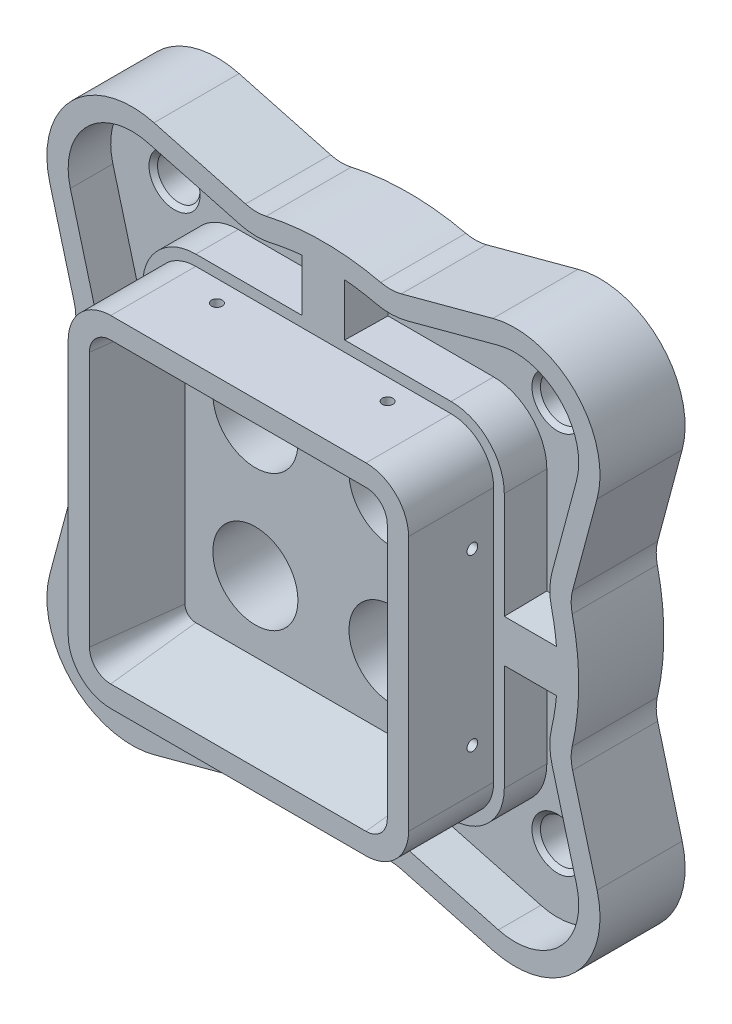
from build123d import *

# Parameters (mm, degrees)
BASE_EXTRUDE_DEPTH      = 25.4
BOSS_EXTRUDE1_DEPTH     = 25.4
CUT_EXTRUDE1_DEPTH      = 25.4
CUT_EXTRUDE1_DRAFT      = -7
SKETCH4_R               = 12.7
CUT_EXTRUDE2_DEPTH      = 120.474537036
CUT_EXTRUDE3_DEPTH      = 12.7
BOSS_EXTRUDE2_START     = -12.7
SKETCH6_W               = 25.134955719
SKETCH6_H               = 12.7
BOSS_EXTRUDE2_DEPTH     = 12.7
CIRPATTERN1_COUNT       = 4
CUT_EXTRUDE4_DEPTH      = 12.7
CUT_EXTRUDE4_DEPTH_BACK = 123.803155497
SKETCH7_R               = 6.35
DRAFT1_ANGLE            = 1
CHAMFER1_SIZE           = 1.27
HOLE1_D                 = 3.175
HOLE1_DEPTH             = 5.08
HOLE1_TIP               = 0.953866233
HOLE2_D                 = 3.175
HOLE2_DEPTH             = 5.08
HOLE2_TIP               = 0.953866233
HOLE3_D                 = 3.175
HOLE3_DEPTH             = 5.08
HOLE3_TIP               = 0.953866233
HOLE4_D                 = 3.175
HOLE4_DEPTH             = 5.08
HOLE4_TIP               = 0.953866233
HOLE5_D                 = 3.175
HOLE5_DEPTH             = 5.08
HOLE5_TIP               = 0.953866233
HOLE6_D                 = 3.175
HOLE6_DEPTH             = 5.08
HOLE6_TIP               = 0.953866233
HOLE7_D                 = 3.175
HOLE7_DEPTH             = 5.08
HOLE7_TIP               = 0.953866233
HOLE8_D                 = 3.175
HOLE8_DEPTH             = 5.08
HOLE8_TIP               = 0.953866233
CUT_EXTRUDE5_START      = -3.175
SKETCH17_R              = 69.85
SKETCH17_R_2            = 50.8
CUT_EXTRUDE5_DEPTH      = 3.175


with BuildPart() as part:
    # Sketch1 → Base-Extrude (new body)
    with BuildSketch(Plane.XY):
        with BuildLine():
            Line((-50.575996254, 81.684515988), (-23.24962088, 74.362435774))
            ThreePointArc((-23.24962088, 74.362435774), (-20.186868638, 73.931673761), (-17.110816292, 74.25402323))
            ThreePointArc((-17.110816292, 74.25402323), (0, 76.2), (17.110816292, 74.25402323))
            ThreePointArc((17.110816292, 74.25402323), (20.186868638, 73.931673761), (23.24962088, 74.362435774))
            Line((23.24962088, 74.362435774), (50.575996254, 81.684515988))
            ThreePointArc((50.575996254, 81.684515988), (75.110512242, 75.110512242), (81.684515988, 50.575996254))
            Line((81.684515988, 50.575996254), (74.362435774, 23.24962088))
            ThreePointArc((74.362435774, 23.24962088), (73.931673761, 20.186868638), (74.25402323, 17.110816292))
            ThreePointArc((74.25402323, 17.110816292), (76.2, 0), (74.25402323, -17.110816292))
            ThreePointArc((74.25402323, -17.110816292), (73.931673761, -20.186868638), (74.362435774, -23.24962088))
            Line((74.362435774, -23.24962088), (81.684515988, -50.575996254))
            ThreePointArc((81.684515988, -50.575996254), (75.110512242, -75.110512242), (50.575996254, -81.684515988))
            Line((50.575996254, -81.684515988), (23.24962088, -74.362435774))
            ThreePointArc((23.24962088, -74.362435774), (20.186868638, -73.931673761), (17.110816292, -74.25402323))
            ThreePointArc((17.110816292, -74.25402323), (0, -76.2), (-17.110816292, -74.25402323))
            ThreePointArc((-17.110816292, -74.25402323), (-20.186868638, -73.931673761), (-23.24962088, -74.362435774))
            Line((-23.24962088, -74.362435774), (-50.575996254, -81.684515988))
            ThreePointArc((-50.575996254, -81.684515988), (-75.110512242, -75.110512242), (-81.684515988, -50.575996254))
            Line((-81.684515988, -50.575996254), (-74.362435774, -23.24962088))
            ThreePointArc((-74.362435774, -23.24962088), (-73.931673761, -20.186868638), (-74.25402323, -17.110816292))
            ThreePointArc((-74.25402323, -17.110816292), (-76.2, 0), (-74.25402323, 17.110816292))
            ThreePointArc((-74.25402323, 17.110816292), (-73.931673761, 20.186868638), (-74.362435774, 23.24962088))
            Line((-74.362435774, 23.24962088), (-81.684515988, 50.575996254))
            ThreePointArc((-81.684515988, 50.575996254), (-75.110512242, 75.110512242), (-50.575996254, 81.684515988))
        make_face()
    extrude(amount=BASE_EXTRUDE_DEPTH)

    # Sketch2 → Boss-Extrude1 (add)
    with BuildSketch(Plane.XY.offset(25.4)):
        with BuildLine():
            Line((-38.1, 50.8), (38.1, 50.8))
            ThreePointArc((38.1, 50.8), (47.080256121, 47.080256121), (50.8, 38.1))
            Line((50.8, 38.1), (50.8, -38.1))
            ThreePointArc((50.8, -38.1), (47.080256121, -47.080256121), (38.1, -50.8))
            Line((38.1, -50.8), (-38.1, -50.8))
            ThreePointArc((-38.1, -50.8), (-47.080256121, -47.080256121), (-50.8, -38.1))
            Line((-50.8, -38.1), (-50.8, 38.1))
            ThreePointArc((-50.8, 38.1), (-47.080256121, 47.080256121), (-38.1, 50.8))
        make_face()
    extrude(amount=BOSS_EXTRUDE1_DEPTH)


with BuildPart() as cut_extrude1_tool:
    # Sketch3 → Cut-Extrude1 (with draft: the straight prism first)
    with BuildSketch(Plane.XY.offset(50.8)):
        with BuildLine():
            Line((-44.45, 38.1), (-44.45, -38.1))
            ThreePointArc((-44.45, -38.1), (-42.590128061, -42.590128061), (-38.1, -44.45))
            Line((-38.1, -44.45), (38.1, -44.45))
            ThreePointArc((38.1, -44.45), (42.590128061, -42.590128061), (44.45, -38.1))
            Line((44.45, -38.1), (44.45, 38.1))
            ThreePointArc((44.45, 38.1), (42.590128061, 42.590128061), (38.1, 44.45))
            Line((38.1, 44.45), (-38.1, 44.45))
            ThreePointArc((-38.1, 44.45), (-42.590128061, 42.590128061), (-44.45, 38.1))
        make_face()
    extrude(amount=-CUT_EXTRUDE1_DEPTH)
    # Cut-Extrude1: the draft: its side faces are tilted about the plane it starts from
    cut_extrude1_sides = [cut_extrude1_tool.faces().sort_by_distance(p)[0] for p in [
        (-42.590128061, 42.590128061, 38.1),
        (-44.45, 0, 38.1),
        (-42.590128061, -42.590128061, 38.1),
        (0, -44.45, 38.1),
        (42.590128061, -42.590128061, 38.1),
        (44.45, 0, 38.1),
        (42.590128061, 42.590128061, 38.1),
        (0, 44.45, 38.1),
    ]]
    draft(cut_extrude1_sides, Plane.XY.offset(50.8), CUT_EXTRUDE1_DRAFT)


with BuildPart() as part_1:
    add(part.part)

    # Cut-Extrude1: cut by cut_extrude1_tool
    add(cut_extrude1_tool.part, mode=Mode.SUBTRACT)

    # Sketch4 → Cut-Extrude2 (cut, through all)
    with BuildSketch(Plane.XY.offset(25.4)):
        with Locations((-20.32, 20.32)):
            Circle(SKETCH4_R)
        with Locations((20.32, 20.32)):
            Circle(SKETCH4_R)
        with Locations((20.32, -20.32)):
            Circle(SKETCH4_R)
        with Locations((-20.32, -20.32)):
            Circle(SKETCH4_R)
    extrude(amount=-CUT_EXTRUDE2_DEPTH, mode=Mode.SUBTRACT)

    # Sketch5 → Cut-Extrude3 (cut)
    with BuildSketch(Plane.XY.offset(25.4)):
        with BuildLine():
            Line((-75.550886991, 52.219497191), (-68.228806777, 24.893121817))
            ThreePointArc((-68.228806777, 24.893121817), (-67.582663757, 20.298993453), (-68.066187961, 15.684914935))
            ThreePointArc((-68.066187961, 15.684914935), (-69.85, 0), (-68.066187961, -15.684914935))
            ThreePointArc((-68.066187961, -15.684914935), (-67.582663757, -20.298993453), (-68.228806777, -24.893121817))
            Line((-68.228806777, -24.893121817), (-75.550886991, -52.219497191))
            ThreePointArc((-75.550886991, -52.219497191), (-70.620384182, -70.620384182), (-52.219497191, -75.550886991))
            Line((-52.219497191, -75.550886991), (-24.893121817, -68.228806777))
            ThreePointArc((-24.893121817, -68.228806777), (-20.298993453, -67.582663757), (-15.684914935, -68.066187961))
            ThreePointArc((-15.684914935, -68.066187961), (0, -69.85), (15.684914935, -68.066187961))
            ThreePointArc((15.684914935, -68.066187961), (20.298993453, -67.582663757), (24.893121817, -68.228806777))
            Line((24.893121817, -68.228806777), (52.219497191, -75.550886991))
            ThreePointArc((52.219497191, -75.550886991), (70.620384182, -70.620384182), (75.550886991, -52.219497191))
            Line((75.550886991, -52.219497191), (68.228806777, -24.893121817))
            ThreePointArc((68.228806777, -24.893121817), (67.582663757, -20.298993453), (68.066187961, -15.684914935))
            ThreePointArc((68.066187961, -15.684914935), (69.85, 0), (68.066187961, 15.684914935))
            ThreePointArc((68.066187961, 15.684914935), (67.582663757, 20.298993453), (68.228806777, 24.893121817))
            Line((68.228806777, 24.893121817), (75.550886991, 52.219497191))
            ThreePointArc((75.550886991, 52.219497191), (70.620384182, 70.620384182), (52.219497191, 75.550886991))
            Line((52.219497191, 75.550886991), (24.893121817, 68.228806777))
            ThreePointArc((24.893121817, 68.228806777), (20.298993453, 67.582663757), (15.684914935, 68.066187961))
            ThreePointArc((15.684914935, 68.066187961), (0, 69.85), (-15.684914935, 68.066187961))
            ThreePointArc((-15.684914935, 68.066187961), (-20.298993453, 67.582663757), (-24.893121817, 68.228806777))
            Line((-24.893121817, 68.228806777), (-52.219497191, 75.550886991))
            ThreePointArc((-52.219497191, 75.550886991), (-70.620384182, 70.620384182), (-75.550886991, 52.219497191))
        make_face()
        with BuildLine():
            Line((-53.975, 38.1), (-53.975, -38.1))
            ThreePointArc((-53.975, -38.1), (-49.325320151, -49.325320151), (-38.1, -53.975))
            Line((-38.1, -53.975), (38.1, -53.975))
            ThreePointArc((38.1, -53.975), (49.325320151, -49.325320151), (53.975, -38.1))
            Line((53.975, -38.1), (53.975, 38.1))
            ThreePointArc((53.975, 38.1), (49.325320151, 49.325320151), (38.1, 53.975))
            Line((38.1, 53.975), (-38.1, 53.975))
            ThreePointArc((-38.1, 53.975), (-49.325320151, 49.325320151), (-53.975, 38.1))
        make_face(mode=Mode.SUBTRACT)
    extrude(amount=-CUT_EXTRUDE3_DEPTH, mode=Mode.SUBTRACT)

    # Sketch6 → Boss-Extrude2 (add)
    with BuildSketch(Plane.XY.offset(25.4).offset(BOSS_EXTRUDE2_START)):
        with Locations((63.367477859, 0)):
            Rectangle(SKETCH6_W, SKETCH6_H)
    boss_extrude2 = extrude(amount=BOSS_EXTRUDE2_DEPTH)

    # CirPattern1: Boss-Extrude2 ×4 about axis
    cirpattern1_axis = Axis((0, 0, 0), (0, 0, 1))
    for i in range(1, CIRPATTERN1_COUNT):
        add(boss_extrude2.rotate(cirpattern1_axis, i * 360 / CIRPATTERN1_COUNT))

    # Sketch7 → Cut-Extrude4 (cut, two sides: drawn at the far end of the back side and taken through both)
    with BuildSketch(Plane.XY.offset(12.7).offset(-CUT_EXTRUDE4_DEPTH_BACK)):
        with Locations((57.15, 57.15)):
            Circle(SKETCH7_R)
        with Locations((-57.15, 57.15)):
            Circle(SKETCH7_R)
        with Locations((-57.15, -57.15)):
            Circle(SKETCH7_R)
        with Locations((57.15, -57.15)):
            Circle(SKETCH7_R)
    extrude(amount=CUT_EXTRUDE4_DEPTH + CUT_EXTRUDE4_DEPTH_BACK, mode=Mode.SUBTRACT)

    # Draft1
    draft1_faces = [part_1.faces().sort_by_distance(p)[0] for p in [
        (61.767882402, 6.35, 19.05),
        (6.35, 61.767882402, 19.05),
        (-6.35, 61.767882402, 19.05),
        (-61.767882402, 6.35, 19.05),
        (-61.767882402, -6.35, 19.05),
        (-6.35, -61.767882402, 19.05),
        (6.35, -61.767882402, 19.05),
        (61.767882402, -6.35, 19.05),
    ]]
    draft(draft1_faces, Plane(origin=(-57.15, 57.15, 25.4), x_dir=(1, 0, 0), z_dir=(0, 0, 1)), DRAFT1_ANGLE)

    # Chamfer1
    chamfer1_edges = [part_1.edges().sort_by_distance(p)[0] for p in [
        (50.8, 57.15, 12.7),
        (50.8, 57.15, 0),
        (-63.5, 57.15, 12.7),
        (-63.5, 57.15, 0),
        (-63.5, -57.15, 12.7),
        (-63.5, -57.15, 0),
        (50.8, -57.15, 12.7),
        (50.8, -57.15, 0),
    ]]
    chamfer(chamfer1_edges, length=CHAMFER1_SIZE)

    # Hole1
    with Locations(Plane.XZ.offset(50.8)):
        with Locations((-25.4, 31.75)):
            Hole(HOLE1_D / 2, depth=HOLE1_DEPTH)
            with Locations((0, 0, -(HOLE1_DEPTH + HOLE1_TIP / 2))):  # 118° drill point
                Cone(0, HOLE1_D / 2, HOLE1_TIP, mode=Mode.SUBTRACT)

    # Hole2
    with Locations(Plane.XZ.offset(50.8)):
        with Locations((25.4, 31.75)):
            Hole(HOLE2_D / 2, depth=HOLE2_DEPTH)
            with Locations((0, 0, -(HOLE2_DEPTH + HOLE2_TIP / 2))):  # 118° drill point
                Cone(0, HOLE2_D / 2, HOLE2_TIP, mode=Mode.SUBTRACT)

    # Hole3
    with Locations(Plane.ZY.offset(50.8)):
        with Locations((31.75, 25.4)):
            Hole(HOLE3_D / 2, depth=HOLE3_DEPTH)
            with Locations((0, 0, -(HOLE3_DEPTH + HOLE3_TIP / 2))):  # 118° drill point
                Cone(0, HOLE3_D / 2, HOLE3_TIP, mode=Mode.SUBTRACT)

    # Hole4
    with Locations(Plane.ZY.offset(50.8)):
        with Locations((31.75, -25.4)):
            Hole(HOLE4_D / 2, depth=HOLE4_DEPTH)
            with Locations((0, 0, -(HOLE4_DEPTH + HOLE4_TIP / 2))):  # 118° drill point
                Cone(0, HOLE4_D / 2, HOLE4_TIP, mode=Mode.SUBTRACT)

    # Hole5
    with Locations(Plane(origin=(50.8, 0, 0), x_dir=(0, 0, -1), z_dir=(1, 0, 0))):
        with Locations((-31.75, -25.4)):
            Hole(HOLE5_D / 2, depth=HOLE5_DEPTH)
            with Locations((0, 0, -(HOLE5_DEPTH + HOLE5_TIP / 2))):  # 118° drill point
                Cone(0, HOLE5_D / 2, HOLE5_TIP, mode=Mode.SUBTRACT)

    # Hole6
    with Locations(Plane(origin=(50.8, 0, 0), x_dir=(0, 0, -1), z_dir=(1, 0, 0))):
        with Locations((-31.75, 25.4)):
            Hole(HOLE6_D / 2, depth=HOLE6_DEPTH)
            with Locations((0, 0, -(HOLE6_DEPTH + HOLE6_TIP / 2))):  # 118° drill point
                Cone(0, HOLE6_D / 2, HOLE6_TIP, mode=Mode.SUBTRACT)

    # Hole7
    with Locations(Plane(origin=(0, 50.8, 0), x_dir=(-1, 0, 0), z_dir=(0, 1, 0))):
        with Locations((-25.4, 31.656590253)):
            Hole(HOLE7_D / 2, depth=HOLE7_DEPTH)
            with Locations((0, 0, -(HOLE7_DEPTH + HOLE7_TIP / 2))):  # 118° drill point
                Cone(0, HOLE7_D / 2, HOLE7_TIP, mode=Mode.SUBTRACT)

    # Hole8
    with Locations(Plane(origin=(0, 50.8, 0), x_dir=(-1, 0, 0), z_dir=(0, 1, 0))):
        with Locations((25.45257472, 31.75)):
            Hole(HOLE8_D / 2, depth=HOLE8_DEPTH)
            with Locations((0, 0, -(HOLE8_DEPTH + HOLE8_TIP / 2))):  # 118° drill point
                Cone(0, HOLE8_D / 2, HOLE8_TIP, mode=Mode.SUBTRACT)

    # Sketch17 → Cut-Extrude5 (cut)
    with BuildSketch(Plane(origin=(0, 0, 0), x_dir=(-1, 0, 0), z_dir=(0, 0, -1)).offset(CUT_EXTRUDE5_START)):
        Circle(SKETCH17_R)
        Circle(SKETCH17_R_2, mode=Mode.SUBTRACT)
    extrude(amount=CUT_EXTRUDE5_DEPTH, mode=Mode.SUBTRACT)


solid = part_1.part
